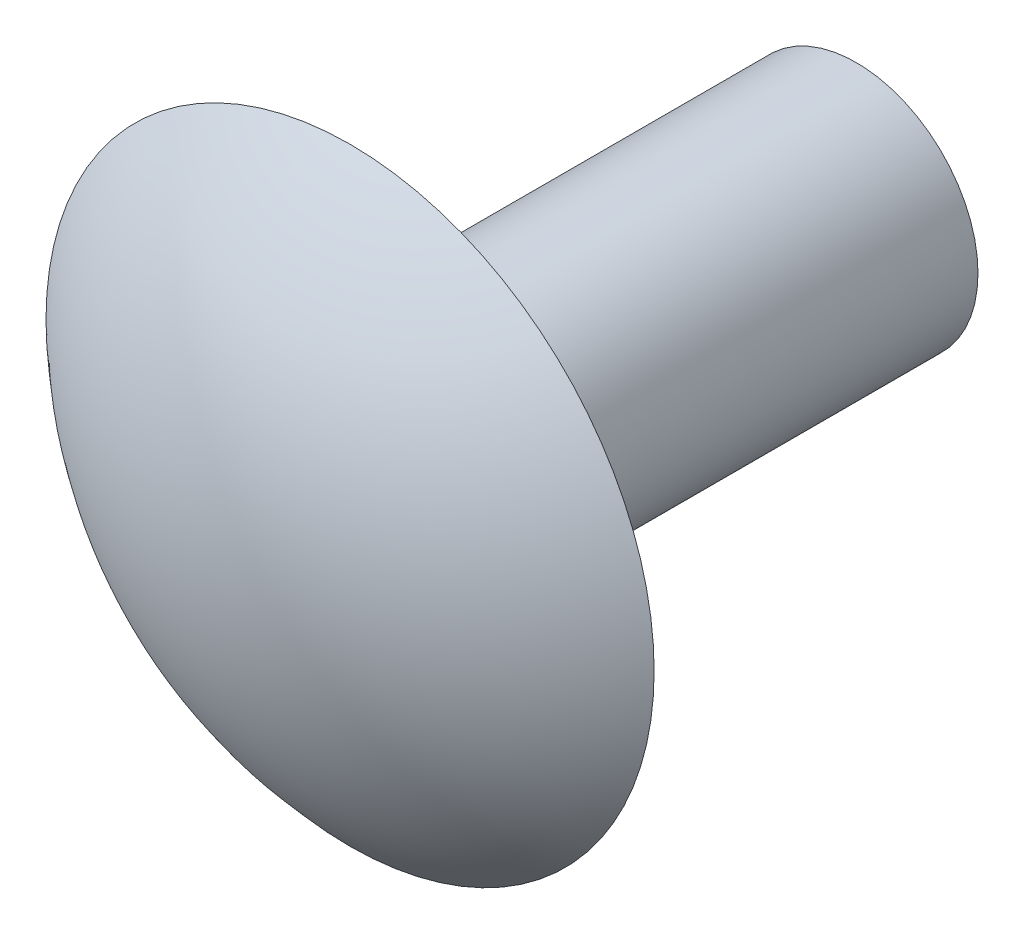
from build123d import *

# Parameters (mm, degrees)
HEAD_DIA_R         = 11.8999
RIVET_HEAD_DEPTH   = 4.7498
SHANK_DIA_R        = 4.7625
RIVET_LENGTH_DEPTH = 19.812


with BuildPart() as part:
    # head dia → Rivet head (new body)
    with BuildSketch(Plane(origin=(0, 0, 0), x_dir=(0, 1, 0), z_dir=(0, 0, 1))):
        with Locations(Location((0, 0, 0), (0, 0, 270))):
            Circle(HEAD_DIA_R)
    extrude(amount=RIVET_HEAD_DEPTH)

    # Sketch3 → dome cut (revolve, cut)
    with BuildSketch(Plane.YZ, mode=Mode.PRIVATE) as dome_cut_sk:
        with BuildLine():
            Line((0, 4.7498), (0, 6.009066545))
            Line((0, 6.009066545), (12.631600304, 6.009066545))
            Line((12.631600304, 6.009066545), (12.631600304, 0))
            Line((12.631600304, 0), (11.8999, 0))
            ThreePointArc((11.8999, 0), (6.406680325, 3.51916822), (0, 4.7498))
        make_face()
    revolve(dome_cut_sk.sketch.rotate(Axis((0, 0, 0), (0, 0, 1)), 90), axis=Axis((0, 0, 0), (0, 0, 1)), mode=Mode.SUBTRACT)

    # shank dia → Rivet Length (add)
    with BuildSketch(Plane(origin=(0, 0, 0), x_dir=(0, 1, 0), z_dir=(0, 0, 1))):
        with Locations(Location((0, 0, 0), (0, 0, 270))):
            Circle(SHANK_DIA_R)
    extrude(amount=-RIVET_LENGTH_DEPTH)


solid = part.part
